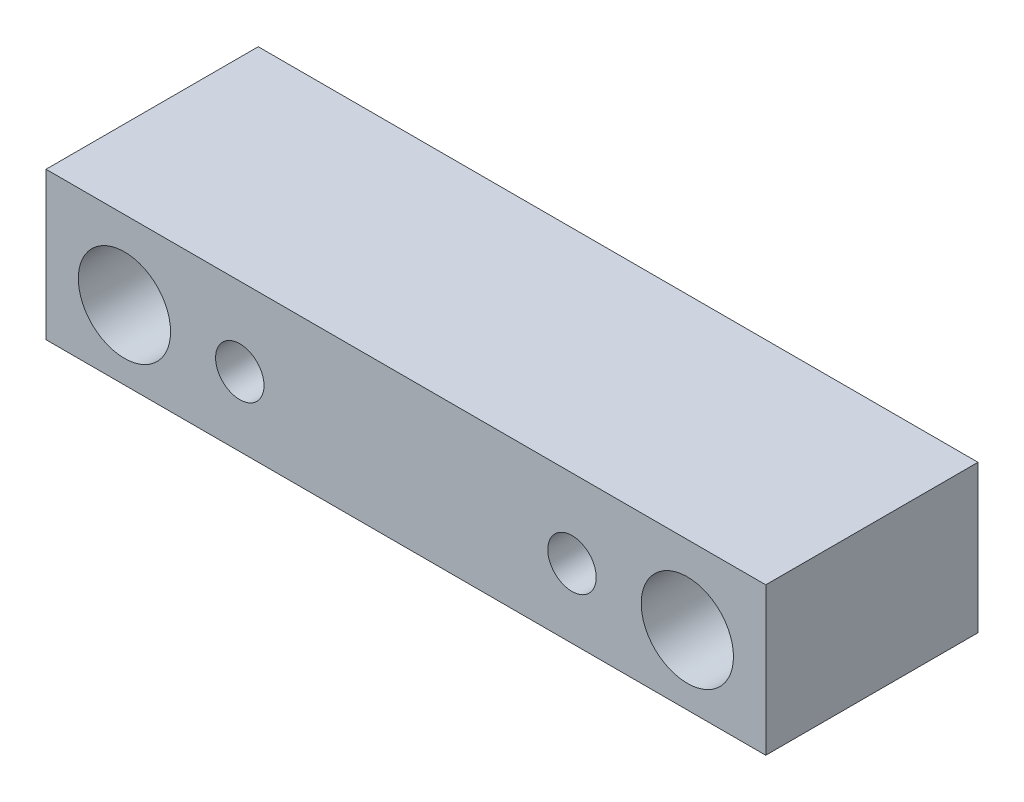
ISO-10303-21;
HEADER;
FILE_DESCRIPTION(('STEP AP214'),'2;1');
FILE_NAME('part.step','',(''),(''),'','','');
FILE_SCHEMA(('AUTOMOTIVE_DESIGN { 1 0 10303 214 1 1 1 1 }'));
ENDSEC;
DATA;
#1=APPLICATION_CONTEXT('core data for automotive mechanical design processes');
#2=APPLICATION_PROTOCOL_DEFINITION('international standard','automotive_design',2000,#1);
#3=PRODUCT_CONTEXT('',#1,'mechanical');
#4=PRODUCT('Part','Part','',(#3));
#5=PRODUCT_RELATED_PRODUCT_CATEGORY('part','',(#4));
#6=PRODUCT_DEFINITION_FORMATION('','',#4);
#7=PRODUCT_DEFINITION_CONTEXT('part definition',#1,'design');
#8=PRODUCT_DEFINITION('design','',#6,#7);
#9=PRODUCT_DEFINITION_SHAPE('','',#8);
#10=(LENGTH_UNIT() NAMED_UNIT(*) SI_UNIT(.MILLI.,.METRE.));
#11=(NAMED_UNIT(*) PLANE_ANGLE_UNIT() SI_UNIT($,.RADIAN.));
#12=(NAMED_UNIT(*) SI_UNIT($,.STERADIAN.) SOLID_ANGLE_UNIT());
#13=UNCERTAINTY_MEASURE_WITH_UNIT(LENGTH_MEASURE(1.E-05),#10,'distance_accuracy_value','');
#14=(GEOMETRIC_REPRESENTATION_CONTEXT(3) GLOBAL_UNCERTAINTY_ASSIGNED_CONTEXT((#13)) GLOBAL_UNIT_ASSIGNED_CONTEXT((#10,
#11,#12)) REPRESENTATION_CONTEXT('',''));
#15=CARTESIAN_POINT('',(0.,0.,0.));
#16=DIRECTION('',(0.,0.,1.));
#17=DIRECTION('',(1.,0.,0.));
#18=AXIS2_PLACEMENT_3D('',#15,#16,#17);
#19=CARTESIAN_POINT('',(-78.,16.,46.));
#20=DIRECTION('',(1.,0.,0.));
#21=DIRECTION('',(0.,0.,-1.));
#22=AXIS2_PLACEMENT_3D('',#19,#20,#21);
#23=PLANE('',#22);
#24=DIRECTION('',(0.,-1.,0.));
#25=VECTOR('',#24,1.);
#26=CARTESIAN_POINT('',(-78.,16.,0.));
#27=LINE('',#26,#25);
#28=CARTESIAN_POINT('',(-78.,16.,0.));
#29=VERTEX_POINT('',#28);
#30=CARTESIAN_POINT('',(-78.,-16.,0.));
#31=VERTEX_POINT('',#30);
#32=EDGE_CURVE('E76',#29,#31,#27,.T.);
#33=ORIENTED_EDGE('',*,*,#32,.T.);
#34=DIRECTION('',(0.,0.,-1.));
#35=VECTOR('',#34,1.);
#36=CARTESIAN_POINT('',(-78.,-16.,46.));
#37=LINE('',#36,#35);
#38=CARTESIAN_POINT('',(-78.,-16.,46.));
#39=VERTEX_POINT('',#38);
#40=EDGE_CURVE('E11',#39,#31,#37,.T.);
#41=ORIENTED_EDGE('',*,*,#40,.F.);
#42=DIRECTION('',(0.,-1.,0.));
#43=VECTOR('',#42,1.);
#44=CARTESIAN_POINT('',(-78.,16.,46.));
#45=LINE('',#44,#43);
#46=CARTESIAN_POINT('',(-78.,16.,46.));
#47=VERTEX_POINT('',#46);
#48=EDGE_CURVE('E99',#47,#39,#45,.T.);
#49=ORIENTED_EDGE('',*,*,#48,.F.);
#50=DIRECTION('',(0.,0.,-1.));
#51=VECTOR('',#50,1.);
#52=CARTESIAN_POINT('',(-78.,16.,46.));
#53=LINE('',#52,#51);
#54=EDGE_CURVE('E88',#47,#29,#53,.T.);
#55=ORIENTED_EDGE('',*,*,#54,.T.);
#56=EDGE_LOOP('',(#33,#41,#49,#55));
#57=FACE_BOUND('',#56,.T.);
#58=ADVANCED_FACE('F32',(#57),#23,.F.);
#59=CARTESIAN_POINT('',(-78.,-16.,46.));
#60=DIRECTION('',(0.,1.,0.));
#61=DIRECTION('',(-1.,0.,0.));
#62=AXIS2_PLACEMENT_3D('',#59,#60,#61);
#63=PLANE('',#62);
#64=DIRECTION('',(1.,0.,0.));
#65=VECTOR('',#64,1.);
#66=CARTESIAN_POINT('',(-78.,-16.,0.));
#67=LINE('',#66,#65);
#68=CARTESIAN_POINT('',(78.,-16.,0.));
#69=VERTEX_POINT('',#68);
#70=EDGE_CURVE('E72',#31,#69,#67,.T.);
#71=ORIENTED_EDGE('',*,*,#70,.T.);
#72=DIRECTION('',(0.,0.,-1.));
#73=VECTOR('',#72,1.);
#74=CARTESIAN_POINT('',(78.,-16.,46.));
#75=LINE('',#74,#73);
#76=CARTESIAN_POINT('',(78.,-16.,46.));
#77=VERTEX_POINT('',#76);
#78=EDGE_CURVE('E39',#77,#69,#75,.T.);
#79=ORIENTED_EDGE('',*,*,#78,.F.);
#80=DIRECTION('',(1.,0.,0.));
#81=VECTOR('',#80,1.);
#82=CARTESIAN_POINT('',(-78.,-16.,46.));
#83=LINE('',#82,#81);
#84=EDGE_CURVE('E84',#39,#77,#83,.T.);
#85=ORIENTED_EDGE('',*,*,#84,.F.);
#86=ORIENTED_EDGE('',*,*,#40,.T.);
#87=EDGE_LOOP('',(#71,#79,#85,#86));
#88=FACE_BOUND('',#87,.T.);
#89=ADVANCED_FACE('F83',(#88),#63,.F.);
#90=CARTESIAN_POINT('',(78.,16.,46.));
#91=DIRECTION('',(-1.,0.,0.));
#92=DIRECTION('',(0.,0.,1.));
#93=AXIS2_PLACEMENT_3D('',#90,#91,#92);
#94=PLANE('',#93);
#95=DIRECTION('',(0.,1.,0.));
#96=VECTOR('',#95,1.);
#97=CARTESIAN_POINT('',(78.,16.,0.));
#98=LINE('',#97,#96);
#99=CARTESIAN_POINT('',(78.,16.,0.));
#100=VERTEX_POINT('',#99);
#101=EDGE_CURVE('E77',#69,#100,#98,.T.);
#102=ORIENTED_EDGE('',*,*,#101,.T.);
#103=DIRECTION('',(0.,0.,-1.));
#104=VECTOR('',#103,1.);
#105=CARTESIAN_POINT('',(78.,16.,46.));
#106=LINE('',#105,#104);
#107=CARTESIAN_POINT('',(78.,16.,46.));
#108=VERTEX_POINT('',#107);
#109=EDGE_CURVE('E105',#108,#100,#106,.T.);
#110=ORIENTED_EDGE('',*,*,#109,.F.);
#111=DIRECTION('',(0.,1.,0.));
#112=VECTOR('',#111,1.);
#113=CARTESIAN_POINT('',(78.,16.,46.));
#114=LINE('',#113,#112);
#115=EDGE_CURVE('E51',#77,#108,#114,.T.);
#116=ORIENTED_EDGE('',*,*,#115,.F.);
#117=ORIENTED_EDGE('',*,*,#78,.T.);
#118=EDGE_LOOP('',(#102,#110,#116,#117));
#119=FACE_BOUND('',#118,.T.);
#120=ADVANCED_FACE('F108',(#119),#94,.F.);
#121=CARTESIAN_POINT('',(-78.,16.,46.));
#122=DIRECTION('',(0.,-1.,0.));
#123=DIRECTION('',(0.,0.,-1.));
#124=AXIS2_PLACEMENT_3D('',#121,#122,#123);
#125=PLANE('',#124);
#126=DIRECTION('',(-1.,0.,0.));
#127=VECTOR('',#126,1.);
#128=CARTESIAN_POINT('',(-78.,16.,0.));
#129=LINE('',#128,#127);
#130=EDGE_CURVE('E97',#100,#29,#129,.T.);
#131=ORIENTED_EDGE('',*,*,#130,.T.);
#132=ORIENTED_EDGE('',*,*,#54,.F.);
#133=DIRECTION('',(-1.,0.,0.));
#134=VECTOR('',#133,1.);
#135=CARTESIAN_POINT('',(-78.,16.,46.));
#136=LINE('',#135,#134);
#137=EDGE_CURVE('E46',#108,#47,#136,.T.);
#138=ORIENTED_EDGE('',*,*,#137,.F.);
#139=ORIENTED_EDGE('',*,*,#109,.T.);
#140=EDGE_LOOP('',(#131,#132,#138,#139));
#141=FACE_BOUND('',#140,.T.);
#142=ADVANCED_FACE('F110',(#141),#125,.F.);
#143=CARTESIAN_POINT('',(-78.,16.,46.));
#144=DIRECTION('',(0.,0.,1.));
#145=DIRECTION('',(1.,0.,0.));
#146=AXIS2_PLACEMENT_3D('',#143,#144,#145);
#147=PLANE('',#146);
#148=CARTESIAN_POINT('',(36.,-1.,46.));
#149=DIRECTION('',(0.,0.,1.));
#150=DIRECTION('',(1.,0.,0.));
#151=AXIS2_PLACEMENT_3D('',#148,#149,#150);
#152=CIRCLE('',#151,5.25);
#153=CARTESIAN_POINT('',(41.25,-1.,46.));
#154=VERTEX_POINT('',#153);
#155=EDGE_CURVE('E197',#154,#154,#152,.T.);
#156=ORIENTED_EDGE('',*,*,#155,.F.);
#157=EDGE_LOOP('',(#156));
#158=FACE_BOUND('',#157,.T.);
#159=CARTESIAN_POINT('',(-36.,-1.,46.));
#160=DIRECTION('',(0.,0.,1.));
#161=DIRECTION('',(1.,0.,0.));
#162=AXIS2_PLACEMENT_3D('',#159,#160,#161);
#163=CIRCLE('',#162,5.25);
#164=CARTESIAN_POINT('',(-30.75,-1.,46.));
#165=VERTEX_POINT('',#164);
#166=EDGE_CURVE('E199',#165,#165,#163,.T.);
#167=ORIENTED_EDGE('',*,*,#166,.F.);
#168=EDGE_LOOP('',(#167));
#169=FACE_BOUND('',#168,.T.);
#170=CARTESIAN_POINT('',(61.,-1.,46.));
#171=DIRECTION('',(0.,0.,1.));
#172=DIRECTION('',(1.,0.,0.));
#173=AXIS2_PLACEMENT_3D('',#170,#171,#172);
#174=CIRCLE('',#173,9.99999999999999);
#175=CARTESIAN_POINT('',(71.,-1.,46.));
#176=VERTEX_POINT('',#175);
#177=EDGE_CURVE('E207',#176,#176,#174,.T.);
#178=ORIENTED_EDGE('',*,*,#177,.F.);
#179=EDGE_LOOP('',(#178));
#180=FACE_BOUND('',#179,.T.);
#181=CARTESIAN_POINT('',(-61.,-1.,46.));
#182=DIRECTION('',(0.,0.,1.));
#183=DIRECTION('',(1.,0.,0.));
#184=AXIS2_PLACEMENT_3D('',#181,#182,#183);
#185=CIRCLE('',#184,10.);
#186=CARTESIAN_POINT('',(-51.,-1.,46.));
#187=VERTEX_POINT('',#186);
#188=EDGE_CURVE('E92',#187,#187,#185,.T.);
#189=ORIENTED_EDGE('',*,*,#188,.F.);
#190=EDGE_LOOP('',(#189));
#191=FACE_BOUND('',#190,.T.);
#192=ORIENTED_EDGE('',*,*,#48,.T.);
#193=ORIENTED_EDGE('',*,*,#84,.T.);
#194=ORIENTED_EDGE('',*,*,#115,.T.);
#195=ORIENTED_EDGE('',*,*,#137,.T.);
#196=EDGE_LOOP('',(#192,#193,#194,#195));
#197=FACE_BOUND('',#196,.T.);
#198=ADVANCED_FACE('F111',(#158,#169,#180,#191,#197),#147,.T.);
#199=CARTESIAN_POINT('',(-78.,16.,0.));
#200=DIRECTION('',(0.,0.,1.));
#201=DIRECTION('',(1.,0.,0.));
#202=AXIS2_PLACEMENT_3D('',#199,#200,#201);
#203=PLANE('',#202);
#204=CARTESIAN_POINT('',(36.,-1.,0.));
#205=DIRECTION('',(0.,0.,1.));
#206=DIRECTION('',(1.,0.,0.));
#207=AXIS2_PLACEMENT_3D('',#204,#205,#206);
#208=CIRCLE('',#207,5.25);
#209=CARTESIAN_POINT('',(41.25,-1.,0.));
#210=VERTEX_POINT('',#209);
#211=EDGE_CURVE('E195',#210,#210,#208,.T.);
#212=ORIENTED_EDGE('',*,*,#211,.T.);
#213=EDGE_LOOP('',(#212));
#214=FACE_BOUND('',#213,.T.);
#215=CARTESIAN_POINT('',(-36.,-1.,0.));
#216=DIRECTION('',(0.,0.,1.));
#217=DIRECTION('',(1.,0.,0.));
#218=AXIS2_PLACEMENT_3D('',#215,#216,#217);
#219=CIRCLE('',#218,5.25);
#220=CARTESIAN_POINT('',(-30.75,-1.,0.));
#221=VERTEX_POINT('',#220);
#222=EDGE_CURVE('E204',#221,#221,#219,.T.);
#223=ORIENTED_EDGE('',*,*,#222,.T.);
#224=EDGE_LOOP('',(#223));
#225=FACE_BOUND('',#224,.T.);
#226=CARTESIAN_POINT('',(61.,-1.,0.));
#227=DIRECTION('',(0.,0.,1.));
#228=DIRECTION('',(1.,0.,0.));
#229=AXIS2_PLACEMENT_3D('',#226,#227,#228);
#230=CIRCLE('',#229,9.99999999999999);
#231=CARTESIAN_POINT('',(71.,-1.,0.));
#232=VERTEX_POINT('',#231);
#233=EDGE_CURVE('E210',#232,#232,#230,.T.);
#234=ORIENTED_EDGE('',*,*,#233,.T.);
#235=EDGE_LOOP('',(#234));
#236=FACE_BOUND('',#235,.T.);
#237=CARTESIAN_POINT('',(-61.,-1.,0.));
#238=DIRECTION('',(0.,0.,1.));
#239=DIRECTION('',(1.,0.,0.));
#240=AXIS2_PLACEMENT_3D('',#237,#238,#239);
#241=CIRCLE('',#240,10.);
#242=CARTESIAN_POINT('',(-51.,-1.,0.));
#243=VERTEX_POINT('',#242);
#244=EDGE_CURVE('E89',#243,#243,#241,.T.);
#245=ORIENTED_EDGE('',*,*,#244,.T.);
#246=EDGE_LOOP('',(#245));
#247=FACE_BOUND('',#246,.T.);
#248=ORIENTED_EDGE('',*,*,#32,.F.);
#249=ORIENTED_EDGE('',*,*,#130,.F.);
#250=ORIENTED_EDGE('',*,*,#101,.F.);
#251=ORIENTED_EDGE('',*,*,#70,.F.);
#252=EDGE_LOOP('',(#248,#249,#250,#251));
#253=FACE_BOUND('',#252,.T.);
#254=ADVANCED_FACE('F73',(#214,#225,#236,#247,#253),#203,.F.);
#255=CARTESIAN_POINT('',(-61.,-1.,0.));
#256=DIRECTION('',(0.,0.,1.));
#257=DIRECTION('',(1.,0.,0.));
#258=AXIS2_PLACEMENT_3D('',#255,#256,#257);
#259=CYLINDRICAL_SURFACE('',#258,10.);
#260=ORIENTED_EDGE('',*,*,#244,.F.);
#261=EDGE_LOOP('',(#260));
#262=FACE_BOUND('',#261,.T.);
#263=ORIENTED_EDGE('',*,*,#188,.T.);
#264=EDGE_LOOP('',(#263));
#265=FACE_BOUND('',#264,.T.);
#266=ADVANCED_FACE('F119',(#262,#265),#259,.F.);
#267=CARTESIAN_POINT('',(61.,-1.,0.));
#268=DIRECTION('',(0.,0.,1.));
#269=DIRECTION('',(1.,0.,0.));
#270=AXIS2_PLACEMENT_3D('',#267,#268,#269);
#271=CYLINDRICAL_SURFACE('',#270,9.99999999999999);
#272=ORIENTED_EDGE('',*,*,#233,.F.);
#273=EDGE_LOOP('',(#272));
#274=FACE_BOUND('',#273,.T.);
#275=ORIENTED_EDGE('',*,*,#177,.T.);
#276=EDGE_LOOP('',(#275));
#277=FACE_BOUND('',#276,.T.);
#278=ADVANCED_FACE('F158',(#274,#277),#271,.F.);
#279=CARTESIAN_POINT('',(-36.,-1.,0.));
#280=DIRECTION('',(0.,0.,1.));
#281=DIRECTION('',(1.,0.,0.));
#282=AXIS2_PLACEMENT_3D('',#279,#280,#281);
#283=CYLINDRICAL_SURFACE('',#282,5.25);
#284=ORIENTED_EDGE('',*,*,#222,.F.);
#285=EDGE_LOOP('',(#284));
#286=FACE_BOUND('',#285,.T.);
#287=ORIENTED_EDGE('',*,*,#166,.T.);
#288=EDGE_LOOP('',(#287));
#289=FACE_BOUND('',#288,.T.);
#290=ADVANCED_FACE('F168',(#286,#289),#283,.F.);
#291=CARTESIAN_POINT('',(36.,-1.,0.));
#292=DIRECTION('',(0.,0.,1.));
#293=DIRECTION('',(1.,0.,0.));
#294=AXIS2_PLACEMENT_3D('',#291,#292,#293);
#295=CYLINDRICAL_SURFACE('',#294,5.25);
#296=ORIENTED_EDGE('',*,*,#211,.F.);
#297=EDGE_LOOP('',(#296));
#298=FACE_BOUND('',#297,.T.);
#299=ORIENTED_EDGE('',*,*,#155,.T.);
#300=EDGE_LOOP('',(#299));
#301=FACE_BOUND('',#300,.T.);
#302=ADVANCED_FACE('F178',(#298,#301),#295,.F.);
#303=CLOSED_SHELL('',(#58,#89,#120,#142,#198,#254,#266,#278,#290,#302));
#304=MANIFOLD_SOLID_BREP('B2',#303);
#305=ADVANCED_BREP_SHAPE_REPRESENTATION('',(#18,#304),#14);
#306=SHAPE_DEFINITION_REPRESENTATION(#9,#305);
ENDSEC;
END-ISO-10303-21;
